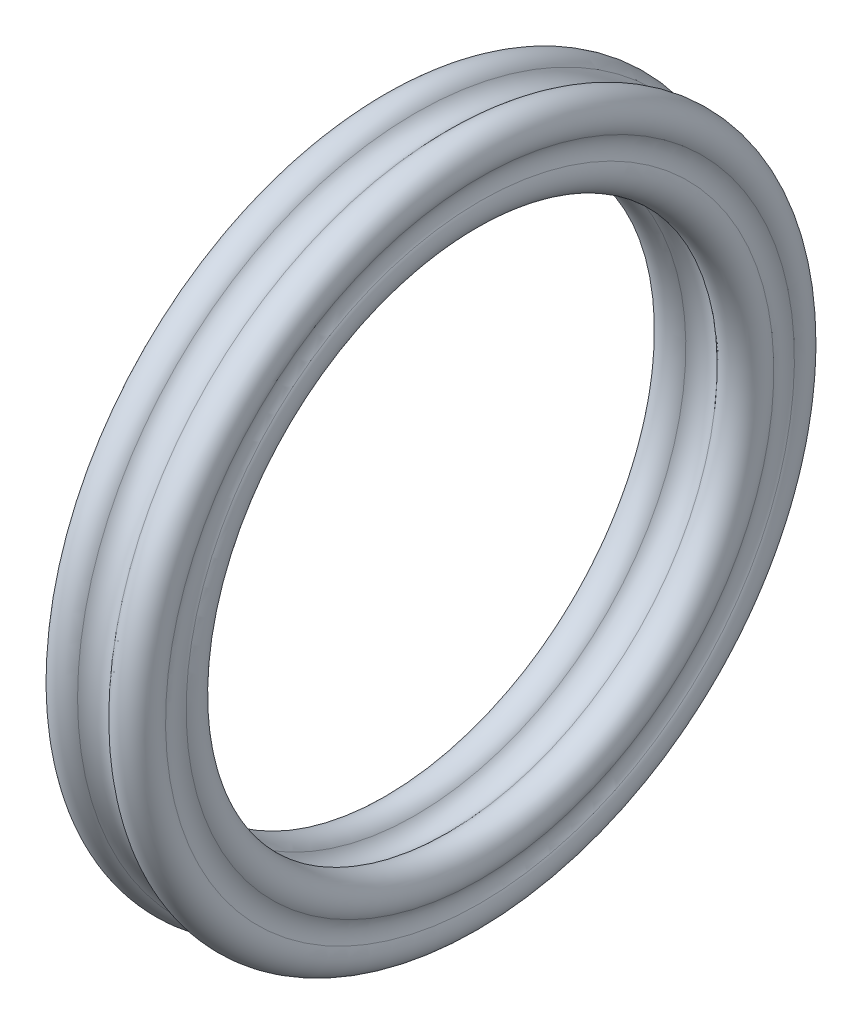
from build123d import *


with BuildPart() as part:
    # Esquisse1 → Base-R_volution (revolve)
    with BuildSketch(Plane.XY, mode=Mode.PRIVATE) as base_r_volution_sk:
        with BuildLine():
            ThreePointArc((18.780777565, 8.514248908), (18.951843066, 7.732001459), (19.745498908, 7.838231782))
            ThreePointArc((19.745498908, 7.838231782), (20.2, 8.051463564), (20.654501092, 7.838231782))
            ThreePointArc((20.654501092, 7.838231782), (21.448156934, 7.732001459), (21.619222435, 8.514248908))
            ThreePointArc((21.619222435, 8.514248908), (21.538444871, 8.8125), (21.619222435, 9.110751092))
            ThreePointArc((21.619222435, 9.110751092), (21.448156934, 9.892998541), (20.654501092, 9.786768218))
            ThreePointArc((20.654501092, 9.786768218), (20.2, 9.573536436), (19.745498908, 9.786768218))
            ThreePointArc((19.745498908, 9.786768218), (18.951843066, 9.892998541), (18.780777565, 9.110751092))
            ThreePointArc((18.780777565, 9.110751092), (18.861555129, 8.8125), (18.780777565, 8.514248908))
        make_face()
    revolve(base_r_volution_sk.sketch.rotate(Axis((17.5, 0, 0), (1, 0, 0)), 180), axis=Axis((17.5, 0, 0), (1, 0, 0)))


solid = part.part
